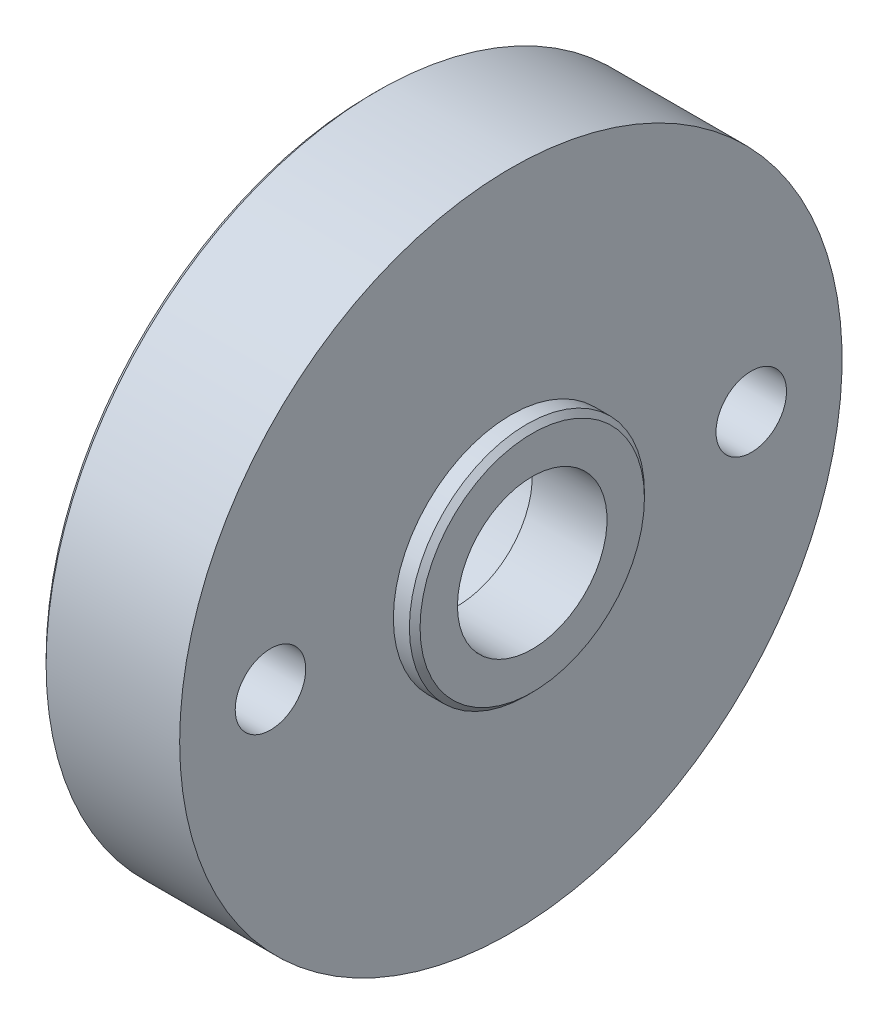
from build123d import *

# Parameters (mm, degrees)
CHANFREIN1_SIZE                                    = 0.5
CHAMBRAGE_POUR_VIS_T_TE_RONDE_BOMB_E_M_D           = 6.6
CHAMBRAGE_POUR_VIS_T_TE_RONDE_BOMB_E_M_CBORE_D     = 13
CHAMBRAGE_POUR_VIS_T_TE_RONDE_BOMB_E_M_CBORE_DEPTH = 6.6


with BuildPart() as part:
    # Esquisse1 → R_volution1 (revolve)
    with BuildSketch(Plane.XY, mode=Mode.PRIVATE) as r_volution1_sk:
        Polygon((0, 11), (0, 31), (13, 31), (13, 11), (15, 11), (15, 7), (8, 7), (8, 11), align=None)
    revolve(r_volution1_sk.sketch.rotate(Axis((0, 0, 0), (1, 0, 0)), 90), axis=Axis((0, 0, 0), (1, 0, 0)))

    # Chanfrein1
    chanfrein1_edges = [part.edges().sort_by_distance(p)[0] for p in [
        (0, 0, -11),
        (0, 0, -31),
        (15, 0, -11),
    ]]
    chamfer(chanfrein1_edges, length=CHANFREIN1_SIZE)

    # Chambrage pour vis _ t_te ronde bomb_e M (through all)
    with Locations(Plane.ZY):
        with Locations((-22.5, 0)):
            chambrage_pour_vis_t_te_ronde_bomb_e_m = CounterBoreHole(CHAMBRAGE_POUR_VIS_T_TE_RONDE_BOMB_E_M_D / 2, CHAMBRAGE_POUR_VIS_T_TE_RONDE_BOMB_E_M_CBORE_D / 2, CHAMBRAGE_POUR_VIS_T_TE_RONDE_BOMB_E_M_CBORE_DEPTH)

    # Sym_trie1: Chambrage pour vis _ t_te ronde bomb_e M across plane
    add(chambrage_pour_vis_t_te_ronde_bomb_e_m.mirror(Plane.XY), mode=Mode.SUBTRACT)


solid = part.part
